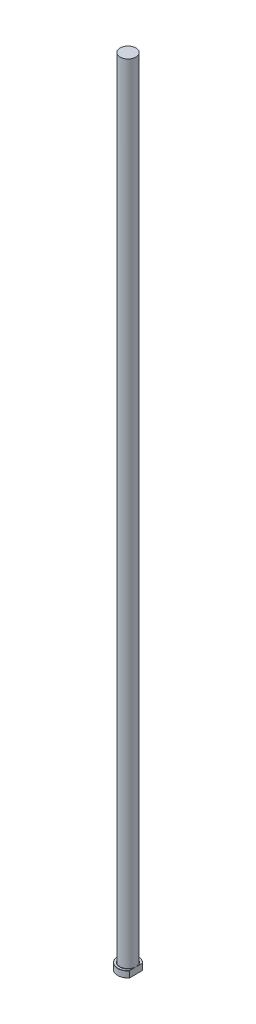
ISO-10303-21;
HEADER;
FILE_DESCRIPTION(('STEP AP214'),'2;1');
FILE_NAME('part.step','',(''),(''),'','','');
FILE_SCHEMA(('AUTOMOTIVE_DESIGN { 1 0 10303 214 1 1 1 1 }'));
ENDSEC;
DATA;
#1=APPLICATION_CONTEXT('core data for automotive mechanical design processes');
#2=APPLICATION_PROTOCOL_DEFINITION('international standard','automotive_design',2000,#1);
#3=PRODUCT_CONTEXT('',#1,'mechanical');
#4=PRODUCT('Part','Part','',(#3));
#5=PRODUCT_RELATED_PRODUCT_CATEGORY('part','',(#4));
#6=PRODUCT_DEFINITION_FORMATION('','',#4);
#7=PRODUCT_DEFINITION_CONTEXT('part definition',#1,'design');
#8=PRODUCT_DEFINITION('design','',#6,#7);
#9=PRODUCT_DEFINITION_SHAPE('','',#8);
#10=(LENGTH_UNIT() NAMED_UNIT(*) SI_UNIT(.MILLI.,.METRE.));
#11=(NAMED_UNIT(*) PLANE_ANGLE_UNIT() SI_UNIT($,.RADIAN.));
#12=(NAMED_UNIT(*) SI_UNIT($,.STERADIAN.) SOLID_ANGLE_UNIT());
#13=UNCERTAINTY_MEASURE_WITH_UNIT(LENGTH_MEASURE(1.E-05),#10,'distance_accuracy_value','');
#14=(GEOMETRIC_REPRESENTATION_CONTEXT(3) GLOBAL_UNCERTAINTY_ASSIGNED_CONTEXT((#13)) GLOBAL_UNIT_ASSIGNED_CONTEXT((#10,
#11,#12)) REPRESENTATION_CONTEXT('',''));
#15=CARTESIAN_POINT('',(0.,0.,0.));
#16=DIRECTION('',(0.,0.,1.));
#17=DIRECTION('',(1.,0.,0.));
#18=AXIS2_PLACEMENT_3D('',#15,#16,#17);
#19=CARTESIAN_POINT('',(0.,0.,0.));
#20=DIRECTION('',(0.,-1.,0.));
#21=DIRECTION('',(0.,0.,-1.));
#22=AXIS2_PLACEMENT_3D('',#19,#20,#21);
#23=PLANE('',#22);
#24=CARTESIAN_POINT('',(0.,0.,0.));
#25=DIRECTION('',(0.,-1.,0.));
#26=DIRECTION('',(0.,0.,-1.));
#27=AXIS2_PLACEMENT_3D('',#24,#25,#26);
#28=CIRCLE('',#27,12.7999999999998);
#29=CARTESIAN_POINT('',(9.99999999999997,0.,7.98999374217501));
#30=VERTEX_POINT('',#29);
#31=CARTESIAN_POINT('',(9.99999999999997,0.,-7.98999374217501));
#32=VERTEX_POINT('',#31);
#33=EDGE_CURVE('E98',#30,#32,#28,.T.);
#34=ORIENTED_EDGE('',*,*,#33,.T.);
#35=DIRECTION('',(0.,0.,1.));
#36=VECTOR('',#35,1.);
#37=CARTESIAN_POINT('',(9.99999999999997,0.,-8.30662386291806));
#38=LINE('',#37,#36);
#39=EDGE_CURVE('E83',#32,#30,#38,.T.);
#40=ORIENTED_EDGE('',*,*,#39,.T.);
#41=EDGE_LOOP('',(#34,#40));
#42=FACE_BOUND('',#41,.T.);
#43=ADVANCED_FACE('F32',(#42),#23,.T.);
#44=CARTESIAN_POINT('',(0.,259.958771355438,0.));
#45=DIRECTION('',(0.,1.,0.));
#46=DIRECTION('',(0.,0.,1.));
#47=AXIS2_PLACEMENT_3D('',#44,#45,#46);
#48=CYLINDRICAL_SURFACE('',#47,13.);
#49=CARTESIAN_POINT('',(0.,7.8000000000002,0.));
#50=DIRECTION('',(0.,1.,0.));
#51=DIRECTION('',(0.,0.,1.));
#52=AXIS2_PLACEMENT_3D('',#49,#50,#51);
#53=CIRCLE('',#52,13.);
#54=CARTESIAN_POINT('',(9.99999999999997,7.8000000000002,8.30662386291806));
#55=VERTEX_POINT('',#54);
#56=CARTESIAN_POINT('',(9.99999999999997,7.8000000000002,-8.30662386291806));
#57=VERTEX_POINT('',#56);
#58=EDGE_CURVE('E104',#55,#57,#53,.F.);
#59=ORIENTED_EDGE('',*,*,#58,.T.);
#60=DIRECTION('',(0.,-1.,0.));
#61=VECTOR('',#60,1.);
#62=CARTESIAN_POINT('',(9.99999999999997,1000.,-8.30662386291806));
#63=LINE('',#62,#61);
#64=CARTESIAN_POINT('',(9.99999999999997,0.200000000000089,-8.30662386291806));
#65=VERTEX_POINT('',#64);
#66=EDGE_CURVE('E183',#57,#65,#63,.T.);
#67=ORIENTED_EDGE('',*,*,#66,.T.);
#68=CARTESIAN_POINT('',(0.,0.200000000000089,0.));
#69=DIRECTION('',(0.,-1.,0.));
#70=DIRECTION('',(0.,0.,-1.));
#71=AXIS2_PLACEMENT_3D('',#68,#69,#70);
#72=CIRCLE('',#71,13.);
#73=CARTESIAN_POINT('',(9.99999999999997,0.200000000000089,8.30662386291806));
#74=VERTEX_POINT('',#73);
#75=EDGE_CURVE('E100',#65,#74,#72,.F.);
#76=ORIENTED_EDGE('',*,*,#75,.T.);
#77=DIRECTION('',(0.,-1.,0.));
#78=VECTOR('',#77,1.);
#79=CARTESIAN_POINT('',(9.99999999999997,1000.,8.30662386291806));
#80=LINE('',#79,#78);
#81=EDGE_CURVE('E93',#55,#74,#80,.T.);
#82=ORIENTED_EDGE('',*,*,#81,.F.);
#83=EDGE_LOOP('',(#59,#67,#76,#82));
#84=FACE_BOUND('',#83,.T.);
#85=ADVANCED_FACE('F158',(#84),#48,.T.);
#86=CARTESIAN_POINT('',(-13.,8.,0.));
#87=DIRECTION('',(0.,1.,0.));
#88=DIRECTION('',(0.,0.,1.));
#89=AXIS2_PLACEMENT_3D('',#86,#87,#88);
#90=PLANE('',#89);
#91=CARTESIAN_POINT('',(0.,8.,0.));
#92=DIRECTION('',(0.,1.,0.));
#93=DIRECTION('',(0.,0.,1.));
#94=AXIS2_PLACEMENT_3D('',#91,#92,#93);
#95=CIRCLE('',#94,12.8000000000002);
#96=CARTESIAN_POINT('',(9.99999999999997,8.,-7.98999374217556));
#97=VERTEX_POINT('',#96);
#98=CARTESIAN_POINT('',(9.99999999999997,8.,7.98999374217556));
#99=VERTEX_POINT('',#98);
#100=EDGE_CURVE('E178',#97,#99,#95,.T.);
#101=ORIENTED_EDGE('',*,*,#100,.T.);
#102=DIRECTION('',(0.,0.,-1.));
#103=VECTOR('',#102,1.);
#104=CARTESIAN_POINT('',(9.99999999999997,8.,0.));
#105=LINE('',#104,#103);
#106=CARTESIAN_POINT('',(9.99999999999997,7.99999999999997,2.46779253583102));
#107=VERTEX_POINT('',#106);
#108=EDGE_CURVE('E57',#99,#107,#105,.T.);
#109=ORIENTED_EDGE('',*,*,#108,.T.);
#110=CARTESIAN_POINT('',(0.,8.,0.));
#111=DIRECTION('',(0.,1.,0.));
#112=DIRECTION('',(0.,0.,1.));
#113=AXIS2_PLACEMENT_3D('',#110,#111,#112);
#114=CIRCLE('',#113,10.3);
#115=CARTESIAN_POINT('',(9.99999999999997,7.99999999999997,-2.4677925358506));
#116=VERTEX_POINT('',#115);
#117=EDGE_CURVE('E107',#107,#116,#114,.F.);
#118=ORIENTED_EDGE('',*,*,#117,.T.);
#119=EDGE_CURVE('E136',#116,#97,#105,.T.);
#120=ORIENTED_EDGE('',*,*,#119,.T.);
#121=EDGE_LOOP('',(#101,#109,#118,#120));
#122=FACE_BOUND('',#121,.T.);
#123=ADVANCED_FACE('F147',(#122),#90,.T.);
#124=CARTESIAN_POINT('',(0.,8.00000000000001,0.));
#125=DIRECTION('',(0.,-1.,0.));
#126=DIRECTION('',(0.,0.,-1.));
#127=AXIS2_PLACEMENT_3D('',#124,#125,#126);
#128=CONICAL_SURFACE('',#127,12.8000000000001,0.785398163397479);
#129=ORIENTED_EDGE('',*,*,#58,.F.);
#130=CARTESIAN_POINT('',(9.99999999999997,-0.0325156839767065,18.2754947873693));
#131=CARTESIAN_POINT('',(9.99999999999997,0.202654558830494,18.0074110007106));
#132=CARTESIAN_POINT('',(9.99999999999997,0.43716113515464,17.7387434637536));
#133=CARTESIAN_POINT('',(9.99999999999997,0.904653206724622,17.2000818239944));
#134=CARTESIAN_POINT('',(9.99999999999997,1.13763868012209,16.930087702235));
#135=CARTESIAN_POINT('',(9.99999999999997,1.60198918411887,16.3885035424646));
#136=CARTESIAN_POINT('',(9.99999999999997,1.83335346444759,16.1169128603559));
#137=CARTESIAN_POINT('',(9.99999999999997,2.29410614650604,15.5720644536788));
#138=CARTESIAN_POINT('',(9.99999999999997,2.52349455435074,15.2988067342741));
#139=CARTESIAN_POINT('',(9.99999999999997,3.2172558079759,14.4654539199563));
#140=CARTESIAN_POINT('',(9.99999999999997,3.67808931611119,13.9023903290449));
#141=CARTESIAN_POINT('',(9.99999999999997,4.35978968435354,13.050261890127));
#142=CARTESIAN_POINT('',(9.99999999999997,4.58540795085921,12.764994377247));
#143=CARTESIAN_POINT('',(9.99999999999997,5.0329001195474,12.1915402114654));
#144=CARTESIAN_POINT('',(9.99999999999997,5.25477408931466,11.9033536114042));
#145=CARTESIAN_POINT('',(9.99999999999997,5.6943125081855,11.3233226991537));
#146=CARTESIAN_POINT('',(9.99999999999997,5.91197246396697,11.0314749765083));
#147=CARTESIAN_POINT('',(9.99999999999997,6.34197664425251,10.4438760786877));
#148=CARTESIAN_POINT('',(9.99999999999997,6.55432081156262,10.1481248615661));
#149=CARTESIAN_POINT('',(9.99999999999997,6.97275454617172,9.55185224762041));
#150=CARTESIAN_POINT('',(9.99999999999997,7.17883878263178,9.25132709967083));
#151=CARTESIAN_POINT('',(9.99999999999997,7.58314110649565,8.64502234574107));
#152=CARTESIAN_POINT('',(9.99999999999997,7.78135936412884,8.33924285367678));
#153=CARTESIAN_POINT('',(9.99999999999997,8.16699130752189,7.72335702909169));
#154=CARTESIAN_POINT('',(9.99999999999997,8.35446043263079,7.41328556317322));
#155=CARTESIAN_POINT('',(9.99999999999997,8.71750578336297,6.7861665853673));
#156=CARTESIAN_POINT('',(9.99999999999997,8.89308056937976,6.4691182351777));
#157=CARTESIAN_POINT('',(9.99999999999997,9.22907765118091,5.82759086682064));
#158=CARTESIAN_POINT('',(9.99999999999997,9.3895205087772,5.50312269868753));
#159=CARTESIAN_POINT('',(9.99999999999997,9.69166927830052,4.84563633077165));
#160=CARTESIAN_POINT('',(9.99999999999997,9.83338220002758,4.5126213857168));
#161=CARTESIAN_POINT('',(9.99999999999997,10.0965229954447,3.8296241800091));
#162=CARTESIAN_POINT('',(9.99999999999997,10.2174003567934,3.47942732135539));
#163=CARTESIAN_POINT('',(9.99999999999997,10.4289934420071,2.7698616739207));
#164=CARTESIAN_POINT('',(9.99999999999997,10.5197138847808,2.41049432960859));
#165=CARTESIAN_POINT('',(9.99999999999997,10.6286544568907,1.86748514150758));
#166=CARTESIAN_POINT('',(9.99999999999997,10.6603769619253,1.68649705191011));
#167=CARTESIAN_POINT('',(9.99999999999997,10.7144435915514,1.32313476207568));
#168=CARTESIAN_POINT('',(9.99999999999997,10.7367891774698,1.14076078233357));
#169=CARTESIAN_POINT('',(9.99999999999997,10.7716587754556,0.775084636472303));
#170=CARTESIAN_POINT('',(9.99999999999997,10.7841833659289,0.591782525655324));
#171=CARTESIAN_POINT('',(9.99999999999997,10.7991548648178,0.224764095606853));
#172=CARTESIAN_POINT('',(9.99999999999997,10.8016017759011,0.0410477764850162));
#173=CARTESIAN_POINT('',(9.99999999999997,10.7963538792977,-0.327017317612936));
#174=CARTESIAN_POINT('',(9.99999999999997,10.7886160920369,-0.51136547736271));
#175=CARTESIAN_POINT('',(9.99999999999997,10.7630873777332,-0.879387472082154));
#176=CARTESIAN_POINT('',(9.99999999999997,10.7452949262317,-1.06306120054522));
#177=CARTESIAN_POINT('',(9.99999999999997,10.7000178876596,-1.42920996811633));
#178=CARTESIAN_POINT('',(9.99999999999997,10.6725330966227,-1.61168498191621));
#179=CARTESIAN_POINT('',(9.99999999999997,10.6083992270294,-1.97502817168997));
#180=CARTESIAN_POINT('',(9.99999999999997,10.5717486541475,-2.15589608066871));
#181=CARTESIAN_POINT('',(9.99999999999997,10.4483311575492,-2.69844589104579));
#182=CARTESIAN_POINT('',(9.99999999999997,10.3484702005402,-3.0571987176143));
#183=CARTESIAN_POINT('',(9.99999999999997,10.1199208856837,-3.76518322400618));
#184=CARTESIAN_POINT('',(9.99999999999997,9.9912307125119,-4.1144143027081));
#185=CARTESIAN_POINT('',(9.99999999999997,9.68849468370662,-4.85781703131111));
#186=CARTESIAN_POINT('',(9.99999999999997,9.51049481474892,-5.25036497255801));
#187=CARTESIAN_POINT('',(9.99999999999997,9.13067200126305,-6.02385434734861));
#188=CARTESIAN_POINT('',(9.99999999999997,8.92883580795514,-6.40478917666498));
#189=CARTESIAN_POINT('',(9.99999999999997,8.50660482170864,-7.15714025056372));
#190=CARTESIAN_POINT('',(9.99999999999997,8.28617401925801,-7.52853612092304));
#191=CARTESIAN_POINT('',(9.99999999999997,7.83133827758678,-8.2625113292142));
#192=CARTESIAN_POINT('',(9.99999999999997,7.5969360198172,-8.62509234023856));
#193=CARTESIAN_POINT('',(9.99999999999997,7.11586721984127,-9.34492022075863));
#194=CARTESIAN_POINT('',(9.99999999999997,6.86913954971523,-9.70212604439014));
#195=CARTESIAN_POINT('',(9.99999999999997,6.36695123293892,-10.4103413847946));
#196=CARTESIAN_POINT('',(9.99999999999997,6.11149026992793,-10.7613506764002));
#197=CARTESIAN_POINT('',(9.99999999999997,5.59387477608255,-11.4577672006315));
#198=CARTESIAN_POINT('',(9.99999999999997,5.33172815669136,-11.803180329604));
#199=CARTESIAN_POINT('',(9.99999999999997,4.80177954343,-12.4896197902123));
#200=CARTESIAN_POINT('',(9.99999999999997,4.53397765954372,-12.8306462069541));
#201=CARTESIAN_POINT('',(9.99999999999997,3.91508653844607,-13.6077378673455));
#202=CARTESIAN_POINT('',(9.99999999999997,3.56244770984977,-14.0425677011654));
#203=CARTESIAN_POINT('',(9.99999999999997,2.85099084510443,-14.9072873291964));
#204=CARTESIAN_POINT('',(9.99999999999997,2.4921714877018,-15.337176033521));
#205=CARTESIAN_POINT('',(9.99999999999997,1.77449197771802,-16.1870689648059));
#206=CARTESIAN_POINT('',(9.99999999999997,1.41569709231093,-16.6071284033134));
#207=CARTESIAN_POINT('',(9.99999999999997,0.69427785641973,-17.4437464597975));
#208=CARTESIAN_POINT('',(9.99999999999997,0.331654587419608,-17.8603060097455));
#209=CARTESIAN_POINT('',(9.99999999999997,-0.032515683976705,-18.2754947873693));
#210=B_SPLINE_CURVE_WITH_KNOTS('',3,(#130,#131,#132,#133,#134,#135,#136,#137,#138,#139,#140,
#141,#142,#143,#144,#145,#146,#147,#148,#149,#150,#151,#152,#153,#154,#155,#156,#157,#158,#159,
#160,#161,#162,#163,#164,#165,#166,#167,#168,#169,#170,#171,#172,#173,#174,#175,#176,#177,#178,
#179,#180,#181,#182,#183,#184,#185,#186,#187,#188,#189,#190,#191,#192,#193,#194,#195,#196,#197,
#198,#199,#200,#201,#202,#203,#204,#205,#206,#207,#208,#209),.UNSPECIFIED.,.F.,.F.,(4,2,2,2,2,2,
2,2,2,2,2,2,2,2,2,2,2,2,2,2,2,2,2,2,2,2,2,2,2,2,2,2,2,2,2,2,2,2,2,4),(0.,1.06984422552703,
2.139703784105,3.21002948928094,4.28035188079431,6.46299853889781,7.55408928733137,
8.64516032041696,9.73733693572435,10.8295252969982,11.9226190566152,13.0156891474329,
14.1024911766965,15.1894245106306,16.274858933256,17.3598859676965,18.470231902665,
19.580404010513,20.1314403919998,20.6823908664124,21.2333088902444,21.7842267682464,
22.3374769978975,22.8908111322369,23.4441569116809,23.9975929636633,25.1131246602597,
26.2287266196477,27.5206979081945,28.813390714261,30.1086470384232,31.4036555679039,
32.7058891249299,34.0081699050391,35.308975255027,36.6097553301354,38.2892289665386,
39.9690662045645,41.6263430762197,43.2831636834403),.UNSPECIFIED.);
#211=EDGE_CURVE('E135',#55,#99,#210,.T.);
#212=ORIENTED_EDGE('',*,*,#211,.T.);
#213=ORIENTED_EDGE('',*,*,#100,.F.);
#214=EDGE_CURVE('E127',#97,#57,#210,.T.);
#215=ORIENTED_EDGE('',*,*,#214,.T.);
#216=EDGE_LOOP('',(#129,#212,#213,#215));
#217=FACE_BOUND('',#216,.T.);
#218=ADVANCED_FACE('F143',(#217),#128,.T.);
#219=CARTESIAN_POINT('',(0.,0.200000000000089,0.));
#220=DIRECTION('',(0.,1.,0.));
#221=DIRECTION('',(0.,0.,1.));
#222=AXIS2_PLACEMENT_3D('',#219,#220,#221);
#223=CONICAL_SURFACE('',#222,13.,0.785398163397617);
#224=ORIENTED_EDGE('',*,*,#75,.F.);
#225=CARTESIAN_POINT('',(9.99999999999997,8.03251568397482,-18.2754947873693));
#226=CARTESIAN_POINT('',(9.99999999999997,7.79734544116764,-18.0074110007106));
#227=CARTESIAN_POINT('',(9.99999999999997,7.56283886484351,-17.7387434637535));
#228=CARTESIAN_POINT('',(9.99999999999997,7.09534679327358,-17.2000818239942));
#229=CARTESIAN_POINT('',(9.99999999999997,6.86236131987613,-16.9300877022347));
#230=CARTESIAN_POINT('',(9.99999999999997,6.39801081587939,-16.3885035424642));
#231=CARTESIAN_POINT('',(9.99999999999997,6.16664653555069,-16.1169128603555));
#232=CARTESIAN_POINT('',(9.99999999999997,5.70589385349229,-15.5720644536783));
#233=CARTESIAN_POINT('',(9.99999999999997,5.47650544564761,-15.2988067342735));
#234=CARTESIAN_POINT('',(9.99999999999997,4.78274419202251,-14.4654539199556));
#235=CARTESIAN_POINT('',(9.99999999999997,4.32191068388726,-13.902390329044));
#236=CARTESIAN_POINT('',(9.99999999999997,3.64021031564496,-13.050261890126));
#237=CARTESIAN_POINT('',(9.99999999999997,3.41459204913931,-12.7649943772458));
#238=CARTESIAN_POINT('',(9.99999999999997,2.96709988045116,-12.1915402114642));
#239=CARTESIAN_POINT('',(9.99999999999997,2.74522591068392,-11.9033536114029));
#240=CARTESIAN_POINT('',(9.99999999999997,2.30568749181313,-11.3233226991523));
#241=CARTESIAN_POINT('',(9.99999999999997,2.08802753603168,-11.0314749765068));
#242=CARTESIAN_POINT('',(9.99999999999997,1.65802335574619,-10.4438760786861));
#243=CARTESIAN_POINT('',(9.99999999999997,1.44567918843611,-10.1481248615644));
#244=CARTESIAN_POINT('',(9.99999999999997,1.02724545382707,-9.55185224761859));
#245=CARTESIAN_POINT('',(9.99999999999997,0.821161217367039,-9.25132709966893));
#246=CARTESIAN_POINT('',(9.99999999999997,0.41685889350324,-8.64502234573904));
#247=CARTESIAN_POINT('',(9.99999999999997,0.218640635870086,-8.33924285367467));
#248=CARTESIAN_POINT('',(9.99999999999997,-0.166991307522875,-7.72335702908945));
#249=CARTESIAN_POINT('',(9.99999999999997,-0.354460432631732,-7.41328556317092));
#250=CARTESIAN_POINT('',(9.99999999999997,-0.717505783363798,-6.78616658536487));
#251=CARTESIAN_POINT('',(9.99999999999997,-0.893080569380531,-6.4691182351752));
#252=CARTESIAN_POINT('',(9.99999999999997,-1.22907765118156,-5.82759086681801));
#253=CARTESIAN_POINT('',(9.99999999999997,-1.38952050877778,-5.50312269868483));
#254=CARTESIAN_POINT('',(9.99999999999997,-1.69166927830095,-4.84563633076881));
#255=CARTESIAN_POINT('',(9.99999999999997,-1.83338220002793,-4.51262138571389));
#256=CARTESIAN_POINT('',(9.99999999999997,-2.09652299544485,-3.82962418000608));
#257=CARTESIAN_POINT('',(9.99999999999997,-2.21740035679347,-3.4794273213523));
#258=CARTESIAN_POINT('',(9.99999999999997,-2.42899344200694,-2.76986167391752));
#259=CARTESIAN_POINT('',(9.99999999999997,-2.51971388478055,-2.41049432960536));
#260=CARTESIAN_POINT('',(9.99999999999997,-2.62865445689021,-1.86748514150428));
#261=CARTESIAN_POINT('',(9.99999999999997,-2.66037696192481,-1.68649705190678));
#262=CARTESIAN_POINT('',(9.99999999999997,-2.71444359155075,-1.32313476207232));
#263=CARTESIAN_POINT('',(9.99999999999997,-2.73678917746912,-1.14076078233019));
#264=CARTESIAN_POINT('',(9.99999999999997,-2.77165877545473,-0.775084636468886));
#265=CARTESIAN_POINT('',(9.99999999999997,-2.78418336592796,-0.591782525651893));
#266=CARTESIAN_POINT('',(9.99999999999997,-2.79915486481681,-0.224764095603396));
#267=CARTESIAN_POINT('',(9.99999999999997,-2.80160177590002,-0.0410477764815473));
#268=CARTESIAN_POINT('',(9.99999999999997,-2.79635387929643,0.327017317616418));
#269=CARTESIAN_POINT('',(9.99999999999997,-2.78861609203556,0.511365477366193));
#270=CARTESIAN_POINT('',(9.99999999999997,-2.76308737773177,0.879387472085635));
#271=CARTESIAN_POINT('',(9.99999999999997,-2.74529492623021,1.0630612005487));
#272=CARTESIAN_POINT('',(9.99999999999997,-2.70001788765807,1.42920996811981));
#273=CARTESIAN_POINT('',(9.99999999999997,-2.67253309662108,1.61168498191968));
#274=CARTESIAN_POINT('',(9.99999999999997,-2.60839922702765,1.97502817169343));
#275=CARTESIAN_POINT('',(9.99999999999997,-2.57174865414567,2.15589608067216));
#276=CARTESIAN_POINT('',(9.99999999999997,-2.44833115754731,2.69844589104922));
#277=CARTESIAN_POINT('',(9.99999999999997,-2.34847020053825,3.05719871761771));
#278=CARTESIAN_POINT('',(9.99999999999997,-2.11992088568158,3.76518322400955));
#279=CARTESIAN_POINT('',(9.99999999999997,-1.99123071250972,4.11441430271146));
#280=CARTESIAN_POINT('',(9.99999999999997,-1.68849468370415,4.85781703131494));
#281=CARTESIAN_POINT('',(9.99999999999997,-1.51049481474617,5.25036497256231));
#282=CARTESIAN_POINT('',(9.99999999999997,-1.13067200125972,6.02385434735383));
#283=CARTESIAN_POINT('',(9.99999999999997,-0.928835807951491,6.40478917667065));
#284=CARTESIAN_POINT('',(9.99999999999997,-0.506604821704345,7.15714025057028));
#285=CARTESIAN_POINT('',(9.99999999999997,-0.286174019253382,7.52853612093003));
#286=CARTESIAN_POINT('',(9.99999999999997,0.168661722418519,8.26251132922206));
#287=CARTESIAN_POINT('',(9.99999999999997,0.403063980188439,8.62509234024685));
#288=CARTESIAN_POINT('',(9.99999999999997,0.884132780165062,9.34492022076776));
#289=CARTESIAN_POINT('',(9.99999999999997,1.13086045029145,9.70212604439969));
#290=CARTESIAN_POINT('',(9.99999999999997,1.63304876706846,10.410341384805));
#291=CARTESIAN_POINT('',(9.99999999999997,1.8885097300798,10.761350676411));
#292=CARTESIAN_POINT('',(9.99999999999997,2.40612522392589,11.4577672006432));
#293=CARTESIAN_POINT('',(9.99999999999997,2.66827184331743,11.803180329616));
#294=CARTESIAN_POINT('',(9.99999999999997,3.19822045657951,12.4896197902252));
#295=CARTESIAN_POINT('',(9.99999999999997,3.46602234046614,12.8306462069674));
#296=CARTESIAN_POINT('',(9.99999999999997,4.0849134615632,13.607737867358));
#297=CARTESIAN_POINT('',(9.99999999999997,4.43755229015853,14.0425677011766));
#298=CARTESIAN_POINT('',(9.99999999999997,5.14900915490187,14.9072873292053));
#299=CARTESIAN_POINT('',(9.99999999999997,5.50782851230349,15.3371760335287));
#300=CARTESIAN_POINT('',(9.99999999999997,6.22550802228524,16.1870689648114));
#301=CARTESIAN_POINT('',(9.99999999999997,6.58430290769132,16.6071284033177));
#302=CARTESIAN_POINT('',(9.99999999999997,7.30572214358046,17.4437464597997));
#303=CARTESIAN_POINT('',(9.99999999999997,7.66834541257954,17.8603060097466));
#304=CARTESIAN_POINT('',(9.99999999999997,8.03251568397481,18.2754947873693));
#305=B_SPLINE_CURVE_WITH_KNOTS('',3,(#225,#226,#227,#228,#229,#230,#231,#232,#233,#234,#235,
#236,#237,#238,#239,#240,#241,#242,#243,#244,#245,#246,#247,#248,#249,#250,#251,#252,#253,#254,
#255,#256,#257,#258,#259,#260,#261,#262,#263,#264,#265,#266,#267,#268,#269,#270,#271,#272,#273,
#274,#275,#276,#277,#278,#279,#280,#281,#282,#283,#284,#285,#286,#287,#288,#289,#290,#291,#292,
#293,#294,#295,#296,#297,#298,#299,#300,#301,#302,#303,#304),.UNSPECIFIED.,.F.,.F.,(4,2,2,2,2,2,
2,2,2,2,2,2,2,2,2,2,2,2,2,2,2,2,2,2,2,2,2,2,2,2,2,2,2,2,2,2,2,2,2,4),(0.,1.0698442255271,
2.13970378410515,3.21002948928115,4.28035188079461,6.46299853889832,7.554089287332,
8.6451603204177,9.7373369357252,10.8295252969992,11.9226190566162,13.0156891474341,
14.1024911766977,15.189424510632,16.2748589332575,17.359885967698,18.4702319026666,
19.5804040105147,20.1314403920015,20.6823908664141,21.2333088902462,21.7842267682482,
22.3374769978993,22.8908111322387,23.4441569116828,23.9975929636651,25.1131246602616,
26.2287266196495,27.520697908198,28.8133907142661,30.1086470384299,31.4036555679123,
32.7058891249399,34.0081699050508,35.3089752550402,36.6097553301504,38.2892289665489,
39.9690662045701,41.6263430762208,43.2831636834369),.UNSPECIFIED.);
#306=EDGE_CURVE('E86',#65,#32,#305,.T.);
#307=ORIENTED_EDGE('',*,*,#306,.T.);
#308=ORIENTED_EDGE('',*,*,#33,.F.);
#309=EDGE_CURVE('E89',#30,#74,#305,.T.);
#310=ORIENTED_EDGE('',*,*,#309,.T.);
#311=EDGE_LOOP('',(#224,#307,#308,#310));
#312=FACE_BOUND('',#311,.T.);
#313=ADVANCED_FACE('F97',(#312),#223,.T.);
#314=CARTESIAN_POINT('',(0.,8.29999999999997,0.));
#315=DIRECTION('',(0.,1.,0.));
#316=DIRECTION('',(0.,0.,1.));
#317=AXIS2_PLACEMENT_3D('',#314,#315,#316);
#318=TOROIDAL_SURFACE('',#317,10.3,0.3);
#319=CARTESIAN_POINT('',(9.99999999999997,8.29999999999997,0.));
#320=CARTESIAN_POINT('',(9.99999999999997,8.3000006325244,1.2894927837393E-10));
#321=CARTESIAN_POINT('',(9.99999999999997,8.30000126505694,-4.00092931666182E-07));
#322=CARTESIAN_POINT('',(9.99999999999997,8.30000243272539,-1.40234418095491E-06));
#323=CARTESIAN_POINT('',(9.99999999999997,8.30000291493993,-2.02945823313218E-06));
#324=CARTESIAN_POINT('',(9.99999999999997,8.30000399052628,-3.57386628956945E-06));
#325=CARTESIAN_POINT('',(9.99999999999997,8.30000456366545,-4.5158581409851E-06));
#326=CARTESIAN_POINT('',(9.99999999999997,8.30000552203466,-6.39352358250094E-06));
#327=CARTESIAN_POINT('',(9.99999999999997,8.3000059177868,-7.32481303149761E-06));
#328=CARTESIAN_POINT('',(9.99999999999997,8.30000752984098,-1.11866731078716E-05));
#329=CARTESIAN_POINT('',(9.99999999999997,8.30000869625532,-1.41456078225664E-05));
#330=CARTESIAN_POINT('',(9.99999999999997,8.30001046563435,-1.98041770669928E-05));
#331=CARTESIAN_POINT('',(9.99999999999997,8.30001112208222,-2.2487618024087E-05));
#332=CARTESIAN_POINT('',(9.99999999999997,8.30001410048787,-3.44834818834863E-05));
#333=CARTESIAN_POINT('',(9.99999999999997,8.30001652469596,-4.37702043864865E-05));
#334=CARTESIAN_POINT('',(9.99999999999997,8.30001986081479,-6.08623690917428E-05));
#335=CARTESIAN_POINT('',(9.99999999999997,8.30002096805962,-6.86285921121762E-05));
#336=CARTESIAN_POINT('',(9.99999999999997,8.3000293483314,-0.00012805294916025));
#337=CARTESIAN_POINT('',(9.99999999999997,8.30003610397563,-0.000179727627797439));
#338=CARTESIAN_POINT('',(9.99999999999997,8.30006561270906,-0.00038619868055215));
#339=CARTESIAN_POINT('',(9.99999999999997,8.30009331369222,-0.000540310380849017));
#340=CARTESIAN_POINT('',(9.99999999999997,8.30020264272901,-0.00115673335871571));
#341=CARTESIAN_POINT('',(9.99999999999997,8.30028138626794,-0.00161935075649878));
#342=CARTESIAN_POINT('',(9.99999999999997,8.30059961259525,-0.00347761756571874));
#343=CARTESIAN_POINT('',(9.99999999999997,8.30084290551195,-0.0048728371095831));
#344=CARTESIAN_POINT('',(9.99999999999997,8.30186502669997,-0.0107472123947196));
#345=CARTESIAN_POINT('',(9.99999999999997,8.30263902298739,-0.0152269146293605));
#346=CARTESIAN_POINT('',(9.99999999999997,8.31278939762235,-0.0739588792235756));
#347=CARTESIAN_POINT('',(9.99999999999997,8.32219581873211,-0.128207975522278));
#348=CARTESIAN_POINT('',(9.99999999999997,8.34198671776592,-0.242894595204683));
#349=CARTESIAN_POINT('',(9.99999999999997,8.35236068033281,-0.303333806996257));
#350=CARTESIAN_POINT('',(9.99999999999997,8.3697713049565,-0.405616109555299));
#351=CARTESIAN_POINT('',(9.99999999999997,8.3768514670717,-0.447451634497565));
#352=CARTESIAN_POINT('',(9.99999999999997,8.39069208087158,-0.529918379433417));
#353=CARTESIAN_POINT('',(9.99999999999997,8.39745582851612,-0.570549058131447));
#354=CARTESIAN_POINT('',(9.99999999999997,8.4352494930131,-0.799879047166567));
#355=CARTESIAN_POINT('',(9.99999999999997,8.46492511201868,-0.988816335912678));
#356=CARTESIAN_POINT('',(9.99999999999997,8.50514159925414,-1.27416595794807));
#357=CARTESIAN_POINT('',(9.99999999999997,8.51790226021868,-1.37026272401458));
#358=CARTESIAN_POINT('',(9.99999999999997,8.54137601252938,-1.56269877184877));
#359=CARTESIAN_POINT('',(9.99999999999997,8.55208934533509,-1.65903802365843));
#360=CARTESIAN_POINT('',(9.99999999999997,8.57171635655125,-1.86082905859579));
#361=CARTESIAN_POINT('',(9.99999999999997,8.58037484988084,-1.96630619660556));
#362=CARTESIAN_POINT('',(9.99999999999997,8.59347501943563,-2.17764173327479));
#363=CARTESIAN_POINT('',(9.99999999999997,8.59791297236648,-2.28350038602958));
#364=CARTESIAN_POINT('',(9.99999999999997,8.60018116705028,-2.44194031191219));
#365=CARTESIAN_POINT('',(9.99999999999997,8.60021412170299,-2.49449016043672));
#366=CARTESIAN_POINT('',(9.99999999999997,8.5985468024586,-2.59955991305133));
#367=CARTESIAN_POINT('',(9.99999999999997,8.59684676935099,-2.65207982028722));
#368=CARTESIAN_POINT('',(9.99999999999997,8.59132943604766,-2.7569292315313));
#369=CARTESIAN_POINT('',(9.99999999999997,8.58751547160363,-2.80925890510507));
#370=CARTESIAN_POINT('',(9.99999999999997,8.57721394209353,-2.91364681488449));
#371=CARTESIAN_POINT('',(9.99999999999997,8.57072778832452,-2.96570517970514));
#372=CARTESIAN_POINT('',(9.99999999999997,8.55845909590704,-3.04236198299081));
#373=CARTESIAN_POINT('',(9.99999999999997,8.55406015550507,-3.06718232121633));
#374=CARTESIAN_POINT('',(9.99999999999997,8.54426309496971,-3.11664708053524));
#375=CARTESIAN_POINT('',(9.99999999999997,8.53886425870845,-3.14129136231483));
#376=CARTESIAN_POINT('',(9.99999999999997,8.52688550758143,-3.19015398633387));
#377=CARTESIAN_POINT('',(9.99999999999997,8.52031210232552,-3.21437390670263));
#378=CARTESIAN_POINT('',(9.99999999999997,8.50565284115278,-3.26234404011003));
#379=CARTESIAN_POINT('',(9.99999999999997,8.49756823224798,-3.2860946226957));
#380=CARTESIAN_POINT('',(9.99999999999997,8.47930616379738,-3.33303874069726));
#381=CARTESIAN_POINT('',(9.99999999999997,8.46910978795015,-3.35622496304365));
#382=CARTESIAN_POINT('',(9.99999999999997,8.44583688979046,-3.40109767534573));
#383=CARTESIAN_POINT('',(9.99999999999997,8.43277518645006,-3.4227911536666));
#384=CARTESIAN_POINT('',(9.99999999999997,8.41234422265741,-3.44947282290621));
#385=CARTESIAN_POINT('',(9.99999999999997,8.40696910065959,-3.45597309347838));
#386=CARTESIAN_POINT('',(9.99999999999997,8.39560437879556,-3.46843629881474));
#387=CARTESIAN_POINT('',(9.99999999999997,8.38961405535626,-3.47439858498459));
#388=CARTESIAN_POINT('',(9.99999999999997,8.37686927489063,-3.48560282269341));
#389=CARTESIAN_POINT('',(9.99999999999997,8.37010747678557,-3.49083658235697));
#390=CARTESIAN_POINT('',(9.99999999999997,8.3558159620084,-3.50012893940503));
#391=CARTESIAN_POINT('',(9.99999999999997,8.34828839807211,-3.50419071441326));
#392=CARTESIAN_POINT('',(9.99999999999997,8.33495256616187,-3.50966904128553));
#393=CARTESIAN_POINT('',(9.99999999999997,8.32932210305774,-3.5115146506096));
#394=CARTESIAN_POINT('',(9.99999999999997,8.31783314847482,-3.51424608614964));
#395=CARTESIAN_POINT('',(9.99999999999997,8.31197492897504,-3.5151330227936));
#396=CARTESIAN_POINT('',(9.99999999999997,8.30017128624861,-3.51585458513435));
#397=CARTESIAN_POINT('',(9.99999999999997,8.29422562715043,-3.5156854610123));
#398=CARTESIAN_POINT('',(9.99999999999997,8.28245600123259,-3.5143060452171));
#399=CARTESIAN_POINT('',(9.99999999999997,8.2766321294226,-3.51309496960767));
#400=CARTESIAN_POINT('',(9.99999999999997,8.26408629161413,-3.50941038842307));
#401=CARTESIAN_POINT('',(9.99999999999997,8.25742641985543,-3.50672823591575));
#402=CARTESIAN_POINT('',(9.99999999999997,8.2446282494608,-3.50032629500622));
#403=CARTESIAN_POINT('',(9.99999999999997,8.23849100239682,-3.49660447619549));
#404=CARTESIAN_POINT('',(9.99999999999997,8.22322836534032,-3.48593836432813));
#405=CARTESIAN_POINT('',(9.99999999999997,8.21452212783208,-3.47840118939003));
#406=CARTESIAN_POINT('',(9.99999999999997,8.19829740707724,-3.46215047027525));
#407=CARTESIAN_POINT('',(9.99999999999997,8.19078248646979,-3.45343353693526));
#408=CARTESIAN_POINT('',(9.99999999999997,8.16907103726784,-3.42543186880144));
#409=CARTESIAN_POINT('',(9.99999999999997,8.15646161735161,-3.40493410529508));
#410=CARTESIAN_POINT('',(9.99999999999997,8.13394130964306,-3.36256849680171));
#411=CARTESIAN_POINT('',(9.99999999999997,8.12403585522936,-3.34069800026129));
#412=CARTESIAN_POINT('',(9.99999999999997,8.10001076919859,-3.28102790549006));
#413=CARTESIAN_POINT('',(9.99999999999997,8.08762395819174,-3.24253659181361));
#414=CARTESIAN_POINT('',(9.99999999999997,8.06625855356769,-3.16459452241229));
#415=CARTESIAN_POINT('',(9.99999999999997,8.05728845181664,-3.12514163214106));
#416=CARTESIAN_POINT('',(9.99999999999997,8.04173697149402,-3.04517405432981));
#417=CARTESIAN_POINT('',(9.99999999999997,8.03519245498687,-3.00465227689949));
#418=CARTESIAN_POINT('',(9.99999999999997,8.02409415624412,-2.9234105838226));
#419=CARTESIAN_POINT('',(9.99999999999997,8.0195374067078,-2.8826910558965));
#420=CARTESIAN_POINT('',(9.99999999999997,8.00795421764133,-2.7573453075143));
#421=CARTESIAN_POINT('',(9.99999999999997,8.00352270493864,-2.67248037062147));
#422=CARTESIAN_POINT('',(9.99999999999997,7.9993551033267,-2.50262077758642));
#423=CARTESIAN_POINT('',(9.99999999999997,7.99962236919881,-2.41762607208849));
#424=CARTESIAN_POINT('',(9.99999999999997,8.00371104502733,-2.24733475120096));
#425=CARTESIAN_POINT('',(9.99999999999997,8.00754894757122,-2.16203856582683));
#426=CARTESIAN_POINT('',(9.99999999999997,8.01800314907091,-1.99161257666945));
#427=CARTESIAN_POINT('',(9.99999999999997,8.02461987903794,-1.90648280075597));
#428=CARTESIAN_POINT('',(9.99999999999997,8.04643179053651,-1.66587956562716));
#429=CARTESIAN_POINT('',(9.99999999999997,8.06418968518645,-1.51064125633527));
#430=CARTESIAN_POINT('',(9.99999999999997,8.10422160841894,-1.20249798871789));
#431=CARTESIAN_POINT('',(9.99999999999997,8.12644437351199,-1.04958602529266));
#432=CARTESIAN_POINT('',(9.99999999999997,8.15948239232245,-0.836243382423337));
#433=CARTESIAN_POINT('',(9.99999999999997,8.16909985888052,-0.775623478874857));
#434=CARTESIAN_POINT('',(9.99999999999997,8.18897079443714,-0.652687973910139));
#435=CARTESIAN_POINT('',(9.99999999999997,8.1992346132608,-0.590374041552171));
#436=CARTESIAN_POINT('',(9.99999999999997,8.21713663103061,-0.483134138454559));
#437=CARTESIAN_POINT('',(9.99999999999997,8.22471025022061,-0.438197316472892));
#438=CARTESIAN_POINT('',(9.99999999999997,8.2398772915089,-0.348851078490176));
#439=CARTESIAN_POINT('',(9.99999999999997,8.24746951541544,-0.30444145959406));
#440=CARTESIAN_POINT('',(9.99999999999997,8.26182028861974,-0.220832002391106));
#441=CARTESIAN_POINT('',(9.99999999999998,8.26857235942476,-0.181631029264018));
#442=CARTESIAN_POINT('',(9.99999999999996,8.28242621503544,-0.101524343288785));
#443=CARTESIAN_POINT('',(9.99999999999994,8.2895303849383,-0.0606190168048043));
#444=CARTESIAN_POINT('',(9.99999999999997,8.29736053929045,-0.0152203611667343));
#445=CARTESIAN_POINT('',(9.99999999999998,8.29813373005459,-0.0107340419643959));
#446=CARTESIAN_POINT('',(9.99999999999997,8.29916055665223,-0.00485912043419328));
#447=CARTESIAN_POINT('',(9.99999999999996,8.29940456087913,-0.00346907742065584));
#448=CARTESIAN_POINT('',(9.99999999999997,8.29971826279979,-0.00161621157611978));
#449=CARTESIAN_POINT('',(9.99999999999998,8.29979547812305,-0.00115451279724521));
#450=CARTESIAN_POINT('',(9.99999999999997,8.29990750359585,-0.000539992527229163));
#451=CARTESIAN_POINT('',(9.99999999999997,8.29993630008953,-0.00038627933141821));
#452=CARTESIAN_POINT('',(9.99999999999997,8.2999632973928,-0.000179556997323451));
#453=CARTESIAN_POINT('',(9.99999999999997,8.29996909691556,-0.000127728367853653));
#454=CARTESIAN_POINT('',(9.99999999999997,8.29998090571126,-5.92319127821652E-05));
#455=CARTESIAN_POINT('',(9.99999999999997,8.2999842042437,-4.21300594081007E-05));
#456=CARTESIAN_POINT('',(9.99999999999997,8.2999888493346,-2.24947629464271E-05));
#457=CARTESIAN_POINT('',(9.99999999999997,8.29998949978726,-1.98237694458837E-05));
#458=CARTESIAN_POINT('',(9.99999999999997,8.29999127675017,-1.4167154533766E-05));
#459=CARTESIAN_POINT('',(9.99999999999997,8.29999246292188,-1.11998611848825E-05));
#460=CARTESIAN_POINT('',(9.99999999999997,8.29999408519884,-7.32510164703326E-06));
#461=CARTESIAN_POINT('',(9.99999999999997,8.2999944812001,-6.39283781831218E-06));
#462=CARTESIAN_POINT('',(9.99999999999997,8.29999543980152,-4.51302258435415E-06));
#463=CARTESIAN_POINT('',(9.99999999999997,8.2999960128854,-3.56982568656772E-06));
#464=CARTESIAN_POINT('',(9.99999999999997,8.29999708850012,-2.02579406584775E-06));
#465=CARTESIAN_POINT('',(9.99999999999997,8.2999975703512,-1.39989048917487E-06));
#466=CARTESIAN_POINT('',(9.99999999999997,8.29999873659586,-3.99573162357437E-07));
#467=CARTESIAN_POINT('',(9.99999999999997,8.29999936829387,-1.2878245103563E-10));
#468=CARTESIAN_POINT('',(9.99999999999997,8.29999999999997,0.));
#469=B_SPLINE_CURVE_WITH_KNOTS('',3,(#319,#320,#321,#322,#323,#324,#325,#326,#327,#328,#329,
#330,#331,#332,#333,#334,#335,#336,#337,#338,#339,#340,#341,#342,#343,#344,#345,#346,#347,#348,
#349,#350,#351,#352,#353,#354,#355,#356,#357,#358,#359,#360,#361,#362,#363,#364,#365,#366,#367,
#368,#369,#370,#371,#372,#373,#374,#375,#376,#377,#378,#379,#380,#381,#382,#383,#384,#385,#386,
#387,#388,#389,#390,#391,#392,#393,#394,#395,#396,#397,#398,#399,#400,#401,#402,#403,#404,#405,
#406,#407,#408,#409,#410,#411,#412,#413,#414,#415,#416,#417,#418,#419,#420,#421,#422,#423,#424,
#425,#426,#427,#428,#429,#430,#431,#432,#433,#434,#435,#436,#437,#438,#439,#440,#441,#442,#443,
#444,#445,#446,#447,#448,#449,#450,#451,#452,#453,#454,#455,#456,#457,#458,#459,#460,#461,#462,
#463,#464,#465,#466,#467,#468),.UNSPECIFIED.,.T.,.F.,(4,2,2,2,2,2,2,2,2,2,2,2,2,2,2,2,2,2,2,2,2,
2,2,2,2,2,2,2,2,2,2,2,2,2,2,2,2,2,2,2,2,2,2,2,2,2,2,2,2,2,2,2,2,2,2,2,2,2,2,2,2,2,2,2,2,2,2,2,2,
2,2,2,2,2,4),(0.,1.98246532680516E-06,4.40569586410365E-06,7.67776729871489E-06,
1.071537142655E-05,2.02306846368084E-05,2.85109385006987E-05,5.727819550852E-05,
8.07917080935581E-05,0.000237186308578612,0.000706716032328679,0.00211476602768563,
0.00636329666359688,0.0200018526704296,0.18517497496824,0.369144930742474,0.496435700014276,
0.620005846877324,1.19369866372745,1.48450372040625,1.77527445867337,2.09271424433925,
2.41043381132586,2.56806178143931,2.72566785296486,2.88302592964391,3.04030100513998,
3.11590708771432,3.19156753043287,3.26682097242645,3.34201258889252,3.41790937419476,
3.49342251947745,3.51869744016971,3.54400243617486,3.56957226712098,3.5950721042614,
3.61277731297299,3.63046199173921,3.64820950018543,3.66597037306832,3.68738951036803,
3.70885077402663,3.74320167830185,3.77765344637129,3.84944920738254,3.92138819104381,
4.04238665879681,4.16368392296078,4.28675554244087,4.40964280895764,4.66436434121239,
4.91926774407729,5.17535440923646,5.43148080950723,5.90010007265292,6.36361828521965,
6.54775191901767,6.73721153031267,6.87392319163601,7.00908476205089,7.12841975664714,
7.25297120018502,7.26662883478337,7.27086249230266,7.27226698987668,7.27273594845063,
7.27289226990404,7.27294450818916,7.27295274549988,7.27296230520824,7.27296534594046,
7.27296862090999,7.27297104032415,7.27297302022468),.UNSPECIFIED.);
#470=CARTESIAN_POINT('',(9.99999999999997,8.29999999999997,0.));
#471=VERTEX_POINT('',#470);
#472=EDGE_CURVE('E11',#116,#471,#469,.T.);
#473=ORIENTED_EDGE('',*,*,#472,.F.);
#474=ORIENTED_EDGE('',*,*,#117,.F.);
#475=CARTESIAN_POINT('',(9.99999999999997,8.29999999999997,0.));
#476=CARTESIAN_POINT('',(9.99999999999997,8.29999936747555,-1.2894930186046E-10));
#477=CARTESIAN_POINT('',(9.99999999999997,8.29999873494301,4.0009293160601E-07));
#478=CARTESIAN_POINT('',(9.99999999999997,8.29999756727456,1.40234418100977E-06));
#479=CARTESIAN_POINT('',(9.99999999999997,8.29999708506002,2.02945823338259E-06));
#480=CARTESIAN_POINT('',(9.99999999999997,8.29999600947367,3.57386628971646E-06));
#481=CARTESIAN_POINT('',(9.99999999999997,8.2999954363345,4.51585814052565E-06));
#482=CARTESIAN_POINT('',(9.99999999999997,8.29999447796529,6.39352358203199E-06));
#483=CARTESIAN_POINT('',(9.99999999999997,8.29999408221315,7.32481303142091E-06));
#484=CARTESIAN_POINT('',(9.99999999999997,8.29999247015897,1.11866731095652E-05));
#485=CARTESIAN_POINT('',(9.99999999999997,8.29999130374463,1.41456078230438E-05));
#486=CARTESIAN_POINT('',(9.99999999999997,8.2999895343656,1.98041770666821E-05));
#487=CARTESIAN_POINT('',(9.99999999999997,8.29998887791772,2.24876180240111E-05));
#488=CARTESIAN_POINT('',(9.99999999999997,8.29998589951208,3.44834818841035E-05));
#489=CARTESIAN_POINT('',(9.99999999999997,8.29998347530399,4.3770204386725E-05));
#490=CARTESIAN_POINT('',(9.99999999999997,8.29998013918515,6.08623690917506E-05));
#491=CARTESIAN_POINT('',(9.99999999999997,8.29997903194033,6.8628592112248E-05));
#492=CARTESIAN_POINT('',(9.99999999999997,8.29997065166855,0.000128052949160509));
#493=CARTESIAN_POINT('',(9.99999999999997,8.29996389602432,0.000179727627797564));
#494=CARTESIAN_POINT('',(9.99999999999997,8.29993438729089,0.000386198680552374));
#495=CARTESIAN_POINT('',(9.99999999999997,8.29990668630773,0.000540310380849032));
#496=CARTESIAN_POINT('',(9.99999999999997,8.29979735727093,0.00115673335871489));
#497=CARTESIAN_POINT('',(9.99999999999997,8.29971861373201,0.00161935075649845));
#498=CARTESIAN_POINT('',(9.99999999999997,8.29940038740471,0.00347761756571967));
#499=CARTESIAN_POINT('',(9.99999999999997,8.299157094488,0.00487283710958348));
#500=CARTESIAN_POINT('',(9.99999999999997,8.29813497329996,0.0107472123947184));
#501=CARTESIAN_POINT('',(9.99999999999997,8.29736097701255,0.0152269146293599));
#502=CARTESIAN_POINT('',(9.99999999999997,8.28721060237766,0.0739588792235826));
#503=CARTESIAN_POINT('',(9.99999999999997,8.27780418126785,0.128207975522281));
#504=CARTESIAN_POINT('',(9.99999999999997,8.25801328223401,0.242894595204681));
#505=CARTESIAN_POINT('',(9.99999999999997,8.24763931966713,0.303333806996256));
#506=CARTESIAN_POINT('',(9.99999999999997,8.23022869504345,0.405616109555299));
#507=CARTESIAN_POINT('',(9.99999999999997,8.22314853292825,0.447451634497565));
#508=CARTESIAN_POINT('',(9.99999999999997,8.20930791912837,0.529918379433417));
#509=CARTESIAN_POINT('',(9.99999999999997,8.20254417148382,0.570549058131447));
#510=CARTESIAN_POINT('',(9.99999999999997,8.16475050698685,0.799879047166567));
#511=CARTESIAN_POINT('',(9.99999999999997,8.13507488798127,0.988816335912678));
#512=CARTESIAN_POINT('',(9.99999999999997,8.0948584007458,1.27416595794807));
#513=CARTESIAN_POINT('',(9.99999999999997,8.08209773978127,1.37026272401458));
#514=CARTESIAN_POINT('',(9.99999999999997,8.05862398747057,1.56269877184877));
#515=CARTESIAN_POINT('',(9.99999999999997,8.04791065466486,1.65903802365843));
#516=CARTESIAN_POINT('',(9.99999999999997,8.0282836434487,1.86082905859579));
#517=CARTESIAN_POINT('',(9.99999999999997,8.01962515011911,1.96630619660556));
#518=CARTESIAN_POINT('',(9.99999999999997,8.00652498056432,2.17764173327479));
#519=CARTESIAN_POINT('',(9.99999999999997,8.00208702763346,2.28350038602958));
#520=CARTESIAN_POINT('',(9.99999999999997,7.99981883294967,2.44194031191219));
#521=CARTESIAN_POINT('',(9.99999999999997,7.99978587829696,2.49449016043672));
#522=CARTESIAN_POINT('',(9.99999999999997,8.00145319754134,2.59955991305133));
#523=CARTESIAN_POINT('',(9.99999999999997,8.00315323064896,2.65207982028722));
#524=CARTESIAN_POINT('',(9.99999999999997,8.00867056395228,2.7569292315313));
#525=CARTESIAN_POINT('',(9.99999999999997,8.01248452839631,2.80925890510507));
#526=CARTESIAN_POINT('',(9.99999999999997,8.02278605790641,2.91364681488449));
#527=CARTESIAN_POINT('',(9.99999999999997,8.02927221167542,2.96570517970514));
#528=CARTESIAN_POINT('',(9.99999999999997,8.04154090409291,3.04236198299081));
#529=CARTESIAN_POINT('',(9.99999999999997,8.04593984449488,3.06718232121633));
#530=CARTESIAN_POINT('',(9.99999999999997,8.05573690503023,3.11664708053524));
#531=CARTESIAN_POINT('',(9.99999999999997,8.0611357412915,3.14129136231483));
#532=CARTESIAN_POINT('',(9.99999999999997,8.07311449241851,3.19015398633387));
#533=CARTESIAN_POINT('',(9.99999999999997,8.07968789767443,3.21437390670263));
#534=CARTESIAN_POINT('',(9.99999999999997,8.09434715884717,3.26234404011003));
#535=CARTESIAN_POINT('',(9.99999999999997,8.10243176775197,3.2860946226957));
#536=CARTESIAN_POINT('',(9.99999999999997,8.12069383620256,3.33303874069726));
#537=CARTESIAN_POINT('',(9.99999999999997,8.13089021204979,3.35622496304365));
#538=CARTESIAN_POINT('',(9.99999999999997,8.15416311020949,3.40109767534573));
#539=CARTESIAN_POINT('',(9.99999999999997,8.16722481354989,3.4227911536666));
#540=CARTESIAN_POINT('',(9.99999999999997,8.18765577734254,3.44947282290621));
#541=CARTESIAN_POINT('',(9.99999999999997,8.19303089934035,3.45597309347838));
#542=CARTESIAN_POINT('',(9.99999999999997,8.20439562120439,3.46843629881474));
#543=CARTESIAN_POINT('',(9.99999999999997,8.21038594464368,3.47439858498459));
#544=CARTESIAN_POINT('',(9.99999999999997,8.22313072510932,3.48560282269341));
#545=CARTESIAN_POINT('',(9.99999999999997,8.22989252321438,3.49083658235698));
#546=CARTESIAN_POINT('',(9.99999999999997,8.24418403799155,3.50012893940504));
#547=CARTESIAN_POINT('',(9.99999999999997,8.25171160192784,3.50419071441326));
#548=CARTESIAN_POINT('',(9.99999999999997,8.26504743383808,3.50966904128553));
#549=CARTESIAN_POINT('',(9.99999999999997,8.27067789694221,3.5115146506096));
#550=CARTESIAN_POINT('',(9.99999999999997,8.28216685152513,3.51424608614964));
#551=CARTESIAN_POINT('',(9.99999999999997,8.28802507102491,3.5151330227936));
#552=CARTESIAN_POINT('',(9.99999999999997,8.29982871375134,3.51585458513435));
#553=CARTESIAN_POINT('',(9.99999999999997,8.30577437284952,3.5156854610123));
#554=CARTESIAN_POINT('',(9.99999999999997,8.31754399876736,3.5143060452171));
#555=CARTESIAN_POINT('',(9.99999999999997,8.32336787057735,3.51309496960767));
#556=CARTESIAN_POINT('',(9.99999999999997,8.33591370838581,3.50941038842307));
#557=CARTESIAN_POINT('',(9.99999999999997,8.34257358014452,3.50672823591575));
#558=CARTESIAN_POINT('',(9.99999999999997,8.35537175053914,3.50032629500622));
#559=CARTESIAN_POINT('',(9.99999999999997,8.36150899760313,3.49660447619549));
#560=CARTESIAN_POINT('',(9.99999999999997,8.37677163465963,3.48593836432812));
#561=CARTESIAN_POINT('',(9.99999999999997,8.38547787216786,3.47840118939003));
#562=CARTESIAN_POINT('',(9.99999999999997,8.4017025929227,3.46215047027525));
#563=CARTESIAN_POINT('',(9.99999999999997,8.40921751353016,3.45343353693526));
#564=CARTESIAN_POINT('',(9.99999999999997,8.43092896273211,3.42543186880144));
#565=CARTESIAN_POINT('',(9.99999999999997,8.44353838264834,3.40493410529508));
#566=CARTESIAN_POINT('',(9.99999999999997,8.46605869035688,3.36256849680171));
#567=CARTESIAN_POINT('',(9.99999999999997,8.47596414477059,3.34069800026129));
#568=CARTESIAN_POINT('',(9.99999999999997,8.49998923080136,3.28102790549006));
#569=CARTESIAN_POINT('',(9.99999999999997,8.51237604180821,3.24253659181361));
#570=CARTESIAN_POINT('',(9.99999999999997,8.53374144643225,3.16459452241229));
#571=CARTESIAN_POINT('',(9.99999999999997,8.54271154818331,3.12514163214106));
#572=CARTESIAN_POINT('',(9.99999999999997,8.55826302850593,3.04517405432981));
#573=CARTESIAN_POINT('',(9.99999999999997,8.56480754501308,3.00465227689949));
#574=CARTESIAN_POINT('',(9.99999999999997,8.57590584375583,2.9234105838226));
#575=CARTESIAN_POINT('',(9.99999999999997,8.58046259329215,2.8826910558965));
#576=CARTESIAN_POINT('',(9.99999999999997,8.59204578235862,2.7573453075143));
#577=CARTESIAN_POINT('',(9.99999999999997,8.59647729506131,2.67248037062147));
#578=CARTESIAN_POINT('',(9.99999999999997,8.60064489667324,2.50262077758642));
#579=CARTESIAN_POINT('',(9.99999999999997,8.60037763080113,2.41762607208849));
#580=CARTESIAN_POINT('',(9.99999999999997,8.59628895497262,2.24733475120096));
#581=CARTESIAN_POINT('',(9.99999999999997,8.59245105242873,2.16203856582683));
#582=CARTESIAN_POINT('',(9.99999999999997,8.58199685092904,1.99161257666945));
#583=CARTESIAN_POINT('',(9.99999999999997,8.57538012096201,1.90648280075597));
#584=CARTESIAN_POINT('',(9.99999999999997,8.55356820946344,1.66587956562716));
#585=CARTESIAN_POINT('',(9.99999999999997,8.5358103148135,1.51064125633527));
#586=CARTESIAN_POINT('',(9.99999999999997,8.49577839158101,1.20249798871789));
#587=CARTESIAN_POINT('',(9.99999999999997,8.47355562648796,1.04958602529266));
#588=CARTESIAN_POINT('',(9.99999999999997,8.44051760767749,0.836243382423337));
#589=CARTESIAN_POINT('',(9.99999999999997,8.43090014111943,0.775623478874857));
#590=CARTESIAN_POINT('',(9.99999999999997,8.41102920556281,0.652687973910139));
#591=CARTESIAN_POINT('',(9.99999999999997,8.40076538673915,0.59037404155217));
#592=CARTESIAN_POINT('',(9.99999999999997,8.38286336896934,0.483134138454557));
#593=CARTESIAN_POINT('',(9.99999999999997,8.37528974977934,0.43819731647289));
#594=CARTESIAN_POINT('',(9.99999999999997,8.36012270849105,0.348851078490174));
#595=CARTESIAN_POINT('',(9.99999999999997,8.35253048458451,0.304441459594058));
#596=CARTESIAN_POINT('',(9.99999999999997,8.33817971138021,0.220832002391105));
#597=CARTESIAN_POINT('',(9.99999999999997,8.33142764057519,0.181631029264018));
#598=CARTESIAN_POINT('',(9.99999999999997,8.31757378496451,0.101524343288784));
#599=CARTESIAN_POINT('',(9.99999999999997,8.31046961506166,0.0606190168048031));
#600=CARTESIAN_POINT('',(9.99999999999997,8.3026394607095,0.0152203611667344));
#601=CARTESIAN_POINT('',(9.99999999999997,8.30186626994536,0.0107340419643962));
#602=CARTESIAN_POINT('',(9.99999999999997,8.30083944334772,0.0048591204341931));
#603=CARTESIAN_POINT('',(9.99999999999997,8.30059543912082,0.00346907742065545));
#604=CARTESIAN_POINT('',(9.99999999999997,8.30028173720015,0.00161621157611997));
#605=CARTESIAN_POINT('',(9.99999999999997,8.30020452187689,0.00115451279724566));
#606=CARTESIAN_POINT('',(9.99999999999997,8.3000924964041,0.000539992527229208));
#607=CARTESIAN_POINT('',(9.99999999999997,8.30006369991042,0.00038627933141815));
#608=CARTESIAN_POINT('',(9.99999999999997,8.30003670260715,0.000179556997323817));
#609=CARTESIAN_POINT('',(9.99999999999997,8.30003090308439,0.000127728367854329));
#610=CARTESIAN_POINT('',(9.99999999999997,8.30001909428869,5.92319127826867E-05));
#611=CARTESIAN_POINT('',(9.99999999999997,8.30001579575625,4.21300594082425E-05));
#612=CARTESIAN_POINT('',(9.99999999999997,8.30001115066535,2.24947629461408E-05));
#613=CARTESIAN_POINT('',(9.99999999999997,8.30001050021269,1.98237694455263E-05));
#614=CARTESIAN_POINT('',(9.99999999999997,8.30000872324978,1.41671545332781E-05));
#615=CARTESIAN_POINT('',(9.99999999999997,8.30000753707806,1.11998611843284E-05));
#616=CARTESIAN_POINT('',(9.99999999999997,8.30000591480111,7.32510164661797E-06));
#617=CARTESIAN_POINT('',(9.99999999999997,8.30000551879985,6.39283781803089E-06));
#618=CARTESIAN_POINT('',(9.99999999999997,8.30000456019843,4.51302258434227E-06));
#619=CARTESIAN_POINT('',(9.99999999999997,8.30000398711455,3.56982568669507E-06));
#620=CARTESIAN_POINT('',(9.99999999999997,8.30000291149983,2.02579406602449E-06));
#621=CARTESIAN_POINT('',(9.99999999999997,8.30000242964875,1.39989048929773E-06));
#622=CARTESIAN_POINT('',(9.99999999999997,8.30000126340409,3.99573162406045E-07));
#623=CARTESIAN_POINT('',(9.99999999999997,8.30000063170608,1.28782474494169E-10));
#624=CARTESIAN_POINT('',(9.99999999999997,8.29999999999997,0.));
#625=B_SPLINE_CURVE_WITH_KNOTS('',3,(#475,#476,#477,#478,#479,#480,#481,#482,#483,#484,#485,
#486,#487,#488,#489,#490,#491,#492,#493,#494,#495,#496,#497,#498,#499,#500,#501,#502,#503,#504,
#505,#506,#507,#508,#509,#510,#511,#512,#513,#514,#515,#516,#517,#518,#519,#520,#521,#522,#523,
#524,#525,#526,#527,#528,#529,#530,#531,#532,#533,#534,#535,#536,#537,#538,#539,#540,#541,#542,
#543,#544,#545,#546,#547,#548,#549,#550,#551,#552,#553,#554,#555,#556,#557,#558,#559,#560,#561,
#562,#563,#564,#565,#566,#567,#568,#569,#570,#571,#572,#573,#574,#575,#576,#577,#578,#579,#580,
#581,#582,#583,#584,#585,#586,#587,#588,#589,#590,#591,#592,#593,#594,#595,#596,#597,#598,#599,
#600,#601,#602,#603,#604,#605,#606,#607,#608,#609,#610,#611,#612,#613,#614,#615,#616,#617,#618,
#619,#620,#621,#622,#623,#624),.UNSPECIFIED.,.T.,.F.,(4,2,2,2,2,2,2,2,2,2,2,2,2,2,2,2,2,2,2,2,2,
2,2,2,2,2,2,2,2,2,2,2,2,2,2,2,2,2,2,2,2,2,2,2,2,2,2,2,2,2,2,2,2,2,2,2,2,2,2,2,2,2,2,2,2,2,2,2,2,
2,2,2,2,2,4),(0.,1.98246532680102E-06,4.4056958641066E-06,7.67776730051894E-06,
1.07153714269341E-05,2.02306846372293E-05,2.85109385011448E-05,5.72781955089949E-05,
8.07917080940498E-05,0.000237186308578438,0.000706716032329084,0.00211476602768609,
0.00636329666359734,0.0200018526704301,0.185174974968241,0.369144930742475,0.496435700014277,
0.620005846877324,1.19369866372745,1.48450372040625,1.77527445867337,2.09271424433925,
2.41043381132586,2.56806178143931,2.72566785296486,2.88302592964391,3.04030100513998,
3.11590708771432,3.19156753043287,3.26682097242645,3.34201258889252,3.41790937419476,
3.49342251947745,3.51869744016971,3.54400243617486,3.56957226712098,3.5950721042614,
3.61277731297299,3.63046199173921,3.64820950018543,3.66597037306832,3.68738951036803,
3.70885077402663,3.74320167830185,3.77765344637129,3.84944920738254,3.92138819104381,
4.04238665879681,4.16368392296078,4.28675554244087,4.40964280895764,4.66436434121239,
4.91926774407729,5.17535440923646,5.43148080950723,5.90010007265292,6.36361828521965,
6.54775191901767,6.73721153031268,6.87392319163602,7.00908476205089,7.12841975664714,
7.25297120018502,7.26662883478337,7.27086249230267,7.27226698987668,7.27273594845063,
7.27289226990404,7.27294450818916,7.27295274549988,7.27296230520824,7.27296534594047,
7.27296862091,7.27297104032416,7.27297302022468),.UNSPECIFIED.);
#626=EDGE_CURVE('E46',#471,#107,#625,.T.);
#627=ORIENTED_EDGE('',*,*,#626,.F.);
#628=CARTESIAN_POINT('',(0.,8.29999999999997,0.));
#629=DIRECTION('',(0.,1.,0.));
#630=DIRECTION('',(0.,0.,1.));
#631=AXIS2_PLACEMENT_3D('',#628,#629,#630);
#632=CIRCLE('',#631,9.99999999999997);
#633=EDGE_CURVE('E103',#471,#471,#632,.T.);
#634=ORIENTED_EDGE('',*,*,#633,.F.);
#635=EDGE_LOOP('',(#473,#474,#627,#634));
#636=FACE_BOUND('',#635,.T.);
#637=ADVANCED_FACE('F34',(#636),#318,.F.);
#638=CARTESIAN_POINT('',(0.,259.958771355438,0.));
#639=DIRECTION('',(0.,1.,0.));
#640=DIRECTION('',(0.,0.,1.));
#641=AXIS2_PLACEMENT_3D('',#638,#639,#640);
#642=CYLINDRICAL_SURFACE('',#641,9.99999999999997);
#643=ORIENTED_EDGE('',*,*,#633,.T.);
#644=EDGE_LOOP('',(#643));
#645=FACE_BOUND('',#644,.T.);
#646=CARTESIAN_POINT('',(0.,1000.,0.));
#647=DIRECTION('',(0.,1.,0.));
#648=DIRECTION('',(0.,0.,1.));
#649=AXIS2_PLACEMENT_3D('',#646,#647,#648);
#650=CIRCLE('',#649,9.99999999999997);
#651=CARTESIAN_POINT('',(0.,1000.,9.99999999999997));
#652=VERTEX_POINT('',#651);
#653=EDGE_CURVE('E101',#652,#652,#650,.T.);
#654=ORIENTED_EDGE('',*,*,#653,.F.);
#655=EDGE_LOOP('',(#654));
#656=FACE_BOUND('',#655,.T.);
#657=ADVANCED_FACE('F155',(#645,#656),#642,.T.);
#658=CARTESIAN_POINT('',(-9.99999999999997,1000.,0.));
#659=DIRECTION('',(0.,1.,0.));
#660=DIRECTION('',(0.,0.,1.));
#661=AXIS2_PLACEMENT_3D('',#658,#659,#660);
#662=PLANE('',#661);
#663=ORIENTED_EDGE('',*,*,#653,.T.);
#664=EDGE_LOOP('',(#663));
#665=FACE_BOUND('',#664,.T.);
#666=ADVANCED_FACE('F121',(#665),#662,.T.);
#667=CARTESIAN_POINT('',(9.99999999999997,1000.,-8.30662386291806));
#668=DIRECTION('',(1.,0.,0.));
#669=DIRECTION('',(0.,0.,-1.));
#670=AXIS2_PLACEMENT_3D('',#667,#668,#669);
#671=PLANE('',#670);
#672=ORIENTED_EDGE('',*,*,#66,.F.);
#673=ORIENTED_EDGE('',*,*,#214,.F.);
#674=ORIENTED_EDGE('',*,*,#119,.F.);
#675=ORIENTED_EDGE('',*,*,#472,.T.);
#676=ORIENTED_EDGE('',*,*,#626,.T.);
#677=ORIENTED_EDGE('',*,*,#108,.F.);
#678=ORIENTED_EDGE('',*,*,#211,.F.);
#679=ORIENTED_EDGE('',*,*,#81,.T.);
#680=ORIENTED_EDGE('',*,*,#309,.F.);
#681=ORIENTED_EDGE('',*,*,#39,.F.);
#682=ORIENTED_EDGE('',*,*,#306,.F.);
#683=EDGE_LOOP('',(#672,#673,#674,#675,#676,#677,#678,#679,#680,#681,#682));
#684=FACE_BOUND('',#683,.T.);
#685=ADVANCED_FACE('F85',(#684),#671,.T.);
#686=CLOSED_SHELL('',(#43,#85,#123,#218,#313,#637,#657,#666,#685));
#687=MANIFOLD_SOLID_BREP('B2',#686);
#688=ADVANCED_BREP_SHAPE_REPRESENTATION('',(#18,#687),#14);
#689=SHAPE_DEFINITION_REPRESENTATION(#9,#688);
ENDSEC;
END-ISO-10303-21;
